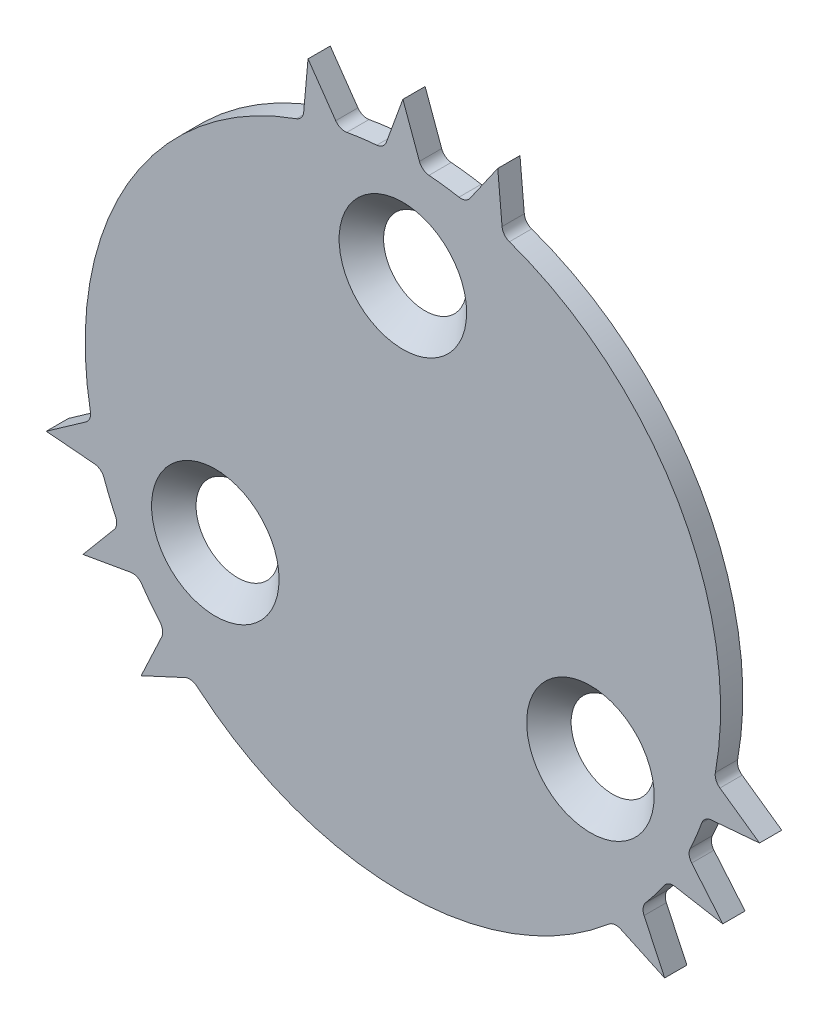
from build123d import *

# Parameters (mm, degrees)
SKIZZE1_R                 = 28.58
LINEAR_AUSTRAGEN1_DEPTH   = 2
LINEAR_AUSTRAGEN2_DEPTH   = 2
KREISMUSTER1_COUNT        = 3
KREISMUSTER1_ANGLE        = 29.76
KREISMUSTER2_COUNT        = 3
KREISMUSTER2_COPY_1_DEPTH = 2
KREISMUSTER2_COPY_2_DEPTH = 2
KREISMUSTER2_COPY_3_DEPTH = 2
KREISMUSTER2_COPY_4_DEPTH = 2


with BuildPart() as part:
    # Skizze1 → Linear austragen1 (new body)
    with BuildSketch(Plane.XY):
        Circle(SKIZZE1_R)
    extrude(amount=LINEAR_AUSTRAGEN1_DEPTH)

    # Skizze2 → Linear austragen2 (add, through all)
    with BuildSketch(Plane.XY.offset(2)):
        with BuildLine():
            Line((-8.533312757, 32.11565776), (-8.921919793, 27.778500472))
            ThreePointArc((-8.921919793, 27.778500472), (-9.127399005, 27.255320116), (-9.582638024, 26.925628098))
            ThreePointArc((-9.582638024, 26.925628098), (-7.339213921, 27.621591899), (-5.046215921, 28.130981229))
            ThreePointArc((-5.046215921, 28.130981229), (-5.605063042, 28.191224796), (-6.043132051, 28.543410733))
            Line((-6.043132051, 28.543410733), (-8.533312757, 32.11565776))
        make_face()
    linear_austragen2 = extrude(amount=-LINEAR_AUSTRAGEN2_DEPTH)

    # Kreismuster1: Linear austragen2 ×3 about axis
    kreismuster1_axis = Axis((0, 0, 0), (0, 0, -1))
    for i in range(1, KREISMUSTER1_COUNT):
        add(linear_austragen2.rotate(kreismuster1_axis, i * KREISMUSTER1_ANGLE / (KREISMUSTER1_COUNT - 1)))

    # Skizze5 → Formsenkung f_r M5 Senkschraube mit Inne (revolve, cut)
    with BuildSketch(Plane(origin=(0, 19.48, 2), x_dir=(0, -1, 0), z_dir=(1, 0, 0))):
        Polygon((0, 0), (0, 2), (2.65, 2), (2.65, 3.085), (5.735, 0), align=None)
    formsenkung_f_r_m5_senkschraube_mit_inne = revolve(axis=Axis((0, 19.48, 8.35), (0, 0, -1)), mode=Mode.SUBTRACT)

    # Kreismuster2: Linear austragen2, Formsenkung f_r M5 Senkschraube mit Inne ×3 about axis
    kreismuster2_axis = Axis((0, 0, 0), (0, 0, 1))
    add([linear_austragen2.rotate(kreismuster2_axis, i * 360 / KREISMUSTER2_COUNT) for i in range(1, KREISMUSTER2_COUNT)])
    add([formsenkung_f_r_m5_senkschraube_mit_inne.rotate(kreismuster2_axis, i * 360 / KREISMUSTER2_COUNT) for i in range(1, KREISMUSTER2_COUNT)], mode=Mode.SUBTRACT)

    # Kreismuster2 copy 1 sketch → Kreismuster2 copy 1 (add, through all)
    with BuildSketch(Plane(origin=(0, 0, 2), x_dir=(-0.26084150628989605, 0.965381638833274, 0), z_dir=(0, 0, 1))):
        with BuildLine():
            Line((-8.533312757, 32.11565776), (-8.921919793, 27.778500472))
            ThreePointArc((-8.921919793, 27.778500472), (-9.127399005, 27.255320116), (-9.582638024, 26.925628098))
            ThreePointArc((-9.582638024, 26.925628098), (-7.339213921, 27.621591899), (-5.046215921, 28.130981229))
            ThreePointArc((-5.046215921, 28.130981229), (-5.605063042, 28.191224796), (-6.043132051, 28.543410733))
            Line((-6.043132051, 28.543410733), (-8.533312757, 32.11565776))
        make_face()
    extrude(amount=-KREISMUSTER2_COPY_1_DEPTH)

    # Kreismuster2 copy 2 sketch → Kreismuster2 copy 2 (add, through all)
    with BuildSketch(Plane(origin=(0, 0, 2), x_dir=(-0.7056242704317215, -0.7085861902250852, 0), z_dir=(0, 0, 1))):
        with BuildLine():
            Line((-8.533312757, 32.11565776), (-8.921919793, 27.778500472))
            ThreePointArc((-8.921919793, 27.778500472), (-9.127399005, 27.255320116), (-9.582638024, 26.925628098))
            ThreePointArc((-9.582638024, 26.925628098), (-7.339213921, 27.621591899), (-5.046215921, 28.130981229))
            ThreePointArc((-5.046215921, 28.130981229), (-5.605063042, 28.191224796), (-6.043132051, 28.543410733))
            Line((-6.043132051, 28.543410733), (-8.533312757, 32.11565776))
        make_face()
    extrude(amount=-KREISMUSTER2_COPY_2_DEPTH)

    # Kreismuster2 copy 3 sketch → Kreismuster2 copy 3 (add, through all)
    with BuildSketch(Plane(origin=(0, 0, 2), x_dir=(-0.004188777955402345, 0.9999912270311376, 0), z_dir=(0, 0, 1))):
        with BuildLine():
            Line((-8.533312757, 32.11565776), (-8.921919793, 27.778500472))
            ThreePointArc((-8.921919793, 27.778500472), (-9.127399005, 27.255320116), (-9.582638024, 26.925628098))
            ThreePointArc((-9.582638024, 26.925628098), (-7.339213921, 27.621591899), (-5.046215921, 28.130981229))
            ThreePointArc((-5.046215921, 28.130981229), (-5.605063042, 28.191224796), (-6.043132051, 28.543410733))
            Line((-6.043132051, 28.543410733), (-8.533312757, 32.11565776))
        make_face()
    extrude(amount=-KREISMUSTER2_COPY_3_DEPTH)

    # Kreismuster2 copy 4 sketch → Kreismuster2 copy 4 (add, through all)
    with BuildSketch(Plane(origin=(0, 0, 2), x_dir=(-0.8639234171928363, -0.5036232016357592, 0), z_dir=(0, 0, 1))):
        with BuildLine():
            Line((-8.533312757, 32.11565776), (-8.921919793, 27.778500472))
            ThreePointArc((-8.921919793, 27.778500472), (-9.127399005, 27.255320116), (-9.582638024, 26.925628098))
            ThreePointArc((-9.582638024, 26.925628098), (-7.339213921, 27.621591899), (-5.046215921, 28.130981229))
            ThreePointArc((-5.046215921, 28.130981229), (-5.605063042, 28.191224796), (-6.043132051, 28.543410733))
            Line((-6.043132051, 28.543410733), (-8.533312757, 32.11565776))
        make_face()
    extrude(amount=-KREISMUSTER2_COPY_4_DEPTH)


solid = part.part
